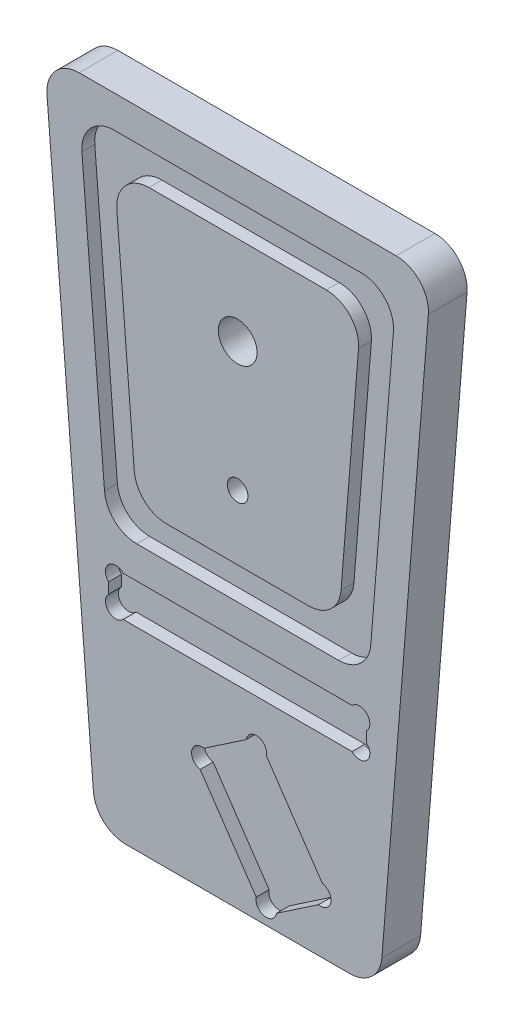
ISO-10303-21;
HEADER;
FILE_DESCRIPTION(('STEP AP214'),'2;1');
FILE_NAME('part.step','',(''),(''),'','','');
FILE_SCHEMA(('AUTOMOTIVE_DESIGN { 1 0 10303 214 1 1 1 1 }'));
ENDSEC;
DATA;
#1=APPLICATION_CONTEXT('core data for automotive mechanical design processes');
#2=APPLICATION_PROTOCOL_DEFINITION('international standard','automotive_design',2000,#1);
#3=PRODUCT_CONTEXT('',#1,'mechanical');
#4=PRODUCT('Part','Part','',(#3));
#5=PRODUCT_RELATED_PRODUCT_CATEGORY('part','',(#4));
#6=PRODUCT_DEFINITION_FORMATION('','',#4);
#7=PRODUCT_DEFINITION_CONTEXT('part definition',#1,'design');
#8=PRODUCT_DEFINITION('design','',#6,#7);
#9=PRODUCT_DEFINITION_SHAPE('','',#8);
#10=(LENGTH_UNIT() NAMED_UNIT(*) SI_UNIT(.MILLI.,.METRE.));
#11=(NAMED_UNIT(*) PLANE_ANGLE_UNIT() SI_UNIT($,.RADIAN.));
#12=(NAMED_UNIT(*) SI_UNIT($,.STERADIAN.) SOLID_ANGLE_UNIT());
#13=UNCERTAINTY_MEASURE_WITH_UNIT(LENGTH_MEASURE(1.E-05),#10,'distance_accuracy_value','');
#14=(GEOMETRIC_REPRESENTATION_CONTEXT(3) GLOBAL_UNCERTAINTY_ASSIGNED_CONTEXT((#13)) GLOBAL_UNIT_ASSIGNED_CONTEXT((#10,
#11,#12)) REPRESENTATION_CONTEXT('',''));
#15=CARTESIAN_POINT('',(0.,0.,0.));
#16=DIRECTION('',(0.,0.,1.));
#17=DIRECTION('',(1.,0.,0.));
#18=AXIS2_PLACEMENT_3D('',#15,#16,#17);
#19=CARTESIAN_POINT('',(-22.,-40.,6.));
#20=DIRECTION('',(0.,1.,0.));
#21=DIRECTION('',(-1.,0.,0.));
#22=AXIS2_PLACEMENT_3D('',#19,#20,#21);
#23=PLANE('',#22);
#24=DIRECTION('',(1.,0.,0.));
#25=VECTOR('',#24,1.);
#26=CARTESIAN_POINT('',(-22.,-40.,0.));
#27=LINE('',#26,#25);
#28=CARTESIAN_POINT('',(-17.3840255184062,-40.,0.));
#29=VERTEX_POINT('',#28);
#30=CARTESIAN_POINT('',(17.3840255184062,-40.,0.));
#31=VERTEX_POINT('',#30);
#32=EDGE_CURVE('E392',#29,#31,#27,.T.);
#33=ORIENTED_EDGE('',*,*,#32,.T.);
#34=DIRECTION('',(0.,0.,-1.));
#35=VECTOR('',#34,1.);
#36=CARTESIAN_POINT('',(17.3840255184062,-40.,6.));
#37=LINE('',#36,#35);
#38=CARTESIAN_POINT('',(17.3840255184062,-40.,6.));
#39=VERTEX_POINT('',#38);
#40=EDGE_CURVE('E33',#31,#39,#37,.F.);
#41=ORIENTED_EDGE('',*,*,#40,.T.);
#42=DIRECTION('',(1.,0.,0.));
#43=VECTOR('',#42,1.);
#44=CARTESIAN_POINT('',(-22.,-40.,6.));
#45=LINE('',#44,#43);
#46=CARTESIAN_POINT('',(-17.3840255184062,-40.,6.));
#47=VERTEX_POINT('',#46);
#48=EDGE_CURVE('E403',#47,#39,#45,.T.);
#49=ORIENTED_EDGE('',*,*,#48,.F.);
#50=DIRECTION('',(0.,0.,-1.));
#51=VECTOR('',#50,1.);
#52=CARTESIAN_POINT('',(-17.3840255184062,-40.,6.));
#53=LINE('',#52,#51);
#54=EDGE_CURVE('E414',#47,#29,#53,.T.);
#55=ORIENTED_EDGE('',*,*,#54,.T.);
#56=EDGE_LOOP('',(#33,#41,#49,#55));
#57=FACE_BOUND('',#56,.T.);
#58=ADVANCED_FACE('F26',(#57),#23,.F.);
#59=CARTESIAN_POINT('',(22.,-40.,6.));
#60=DIRECTION('',(-0.996815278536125,0.0797452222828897,0.));
#61=DIRECTION('',(-0.0797452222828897,-0.996815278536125,0.));
#62=AXIS2_PLACEMENT_3D('',#59,#60,#61);
#63=PLANE('',#62);
#64=DIRECTION('',(0.0797452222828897,0.996815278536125,0.));
#65=VECTOR('',#64,1.);
#66=CARTESIAN_POINT('',(22.,-40.,6.));
#67=LINE('',#66,#65);
#68=CARTESIAN_POINT('',(22.3681019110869,-35.3987261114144,6.));
#69=VERTEX_POINT('',#68);
#70=CARTESIAN_POINT('',(29.5681019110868,54.6012738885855,6.));
#71=VERTEX_POINT('',#70);
#72=EDGE_CURVE('E406',#69,#71,#67,.T.);
#73=ORIENTED_EDGE('',*,*,#72,.F.);
#74=DIRECTION('',(0.,0.,-1.));
#75=VECTOR('',#74,1.);
#76=CARTESIAN_POINT('',(22.3681019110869,-35.3987261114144,6.));
#77=LINE('',#76,#75);
#78=CARTESIAN_POINT('',(22.3681019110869,-35.3987261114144,0.));
#79=VERTEX_POINT('',#78);
#80=EDGE_CURVE('E515',#69,#79,#77,.T.);
#81=ORIENTED_EDGE('',*,*,#80,.T.);
#82=DIRECTION('',(0.0797452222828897,0.996815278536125,0.));
#83=VECTOR('',#82,1.);
#84=CARTESIAN_POINT('',(22.,-40.,0.));
#85=LINE('',#84,#83);
#86=CARTESIAN_POINT('',(29.5681019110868,54.6012738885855,0.));
#87=VERTEX_POINT('',#86);
#88=EDGE_CURVE('E395',#79,#87,#85,.T.);
#89=ORIENTED_EDGE('',*,*,#88,.T.);
#90=DIRECTION('',(0.,0.,-1.));
#91=VECTOR('',#90,1.);
#92=CARTESIAN_POINT('',(29.5681019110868,54.6012738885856,6.));
#93=LINE('',#92,#91);
#94=EDGE_CURVE('E440',#87,#71,#93,.F.);
#95=ORIENTED_EDGE('',*,*,#94,.T.);
#96=EDGE_LOOP('',(#73,#81,#89,#95));
#97=FACE_BOUND('',#96,.T.);
#98=ADVANCED_FACE('F534',(#97),#63,.F.);
#99=CARTESIAN_POINT('',(-30.,60.,6.));
#100=DIRECTION('',(0.,-1.,0.));
#101=DIRECTION('',(1.,0.,0.));
#102=AXIS2_PLACEMENT_3D('',#99,#100,#101);
#103=PLANE('',#102);
#104=DIRECTION('',(-1.,0.,0.));
#105=VECTOR('',#104,1.);
#106=CARTESIAN_POINT('',(-30.,60.,6.));
#107=LINE('',#106,#105);
#108=CARTESIAN_POINT('',(24.5840255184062,60.,6.));
#109=VERTEX_POINT('',#108);
#110=CARTESIAN_POINT('',(-24.5840255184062,60.,6.));
#111=VERTEX_POINT('',#110);
#112=EDGE_CURVE('E408',#109,#111,#107,.T.);
#113=ORIENTED_EDGE('',*,*,#112,.F.);
#114=DIRECTION('',(0.,0.,-1.));
#115=VECTOR('',#114,1.);
#116=CARTESIAN_POINT('',(24.5840255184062,60.,6.));
#117=LINE('',#116,#115);
#118=CARTESIAN_POINT('',(24.5840255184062,60.,0.));
#119=VERTEX_POINT('',#118);
#120=EDGE_CURVE('E437',#109,#119,#117,.T.);
#121=ORIENTED_EDGE('',*,*,#120,.T.);
#122=DIRECTION('',(-1.,0.,0.));
#123=VECTOR('',#122,1.);
#124=CARTESIAN_POINT('',(-30.,60.,0.));
#125=LINE('',#124,#123);
#126=CARTESIAN_POINT('',(-24.5840255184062,60.,0.));
#127=VERTEX_POINT('',#126);
#128=EDGE_CURVE('E397',#119,#127,#125,.T.);
#129=ORIENTED_EDGE('',*,*,#128,.T.);
#130=DIRECTION('',(0.,0.,-1.));
#131=VECTOR('',#130,1.);
#132=CARTESIAN_POINT('',(-24.5840255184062,60.,6.));
#133=LINE('',#132,#131);
#134=EDGE_CURVE('E435',#127,#111,#133,.F.);
#135=ORIENTED_EDGE('',*,*,#134,.T.);
#136=EDGE_LOOP('',(#113,#121,#129,#135));
#137=FACE_BOUND('',#136,.T.);
#138=ADVANCED_FACE('F546',(#137),#103,.F.);
#139=CARTESIAN_POINT('',(-22.,-40.,6.));
#140=DIRECTION('',(0.996815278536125,0.07974522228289,0.));
#141=DIRECTION('',(-0.07974522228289,0.996815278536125,0.));
#142=AXIS2_PLACEMENT_3D('',#139,#140,#141);
#143=PLANE('',#142);
#144=DIRECTION('',(0.07974522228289,-0.996815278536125,0.));
#145=VECTOR('',#144,1.);
#146=CARTESIAN_POINT('',(-22.,-40.,0.));
#147=LINE('',#146,#145);
#148=CARTESIAN_POINT('',(-29.5681019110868,54.6012738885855,0.));
#149=VERTEX_POINT('',#148);
#150=CARTESIAN_POINT('',(-22.3681019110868,-35.3987261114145,0.));
#151=VERTEX_POINT('',#150);
#152=EDGE_CURVE('E400',#149,#151,#147,.T.);
#153=ORIENTED_EDGE('',*,*,#152,.T.);
#154=DIRECTION('',(0.,0.,-1.));
#155=VECTOR('',#154,1.);
#156=CARTESIAN_POINT('',(-22.3681019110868,-35.3987261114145,6.));
#157=LINE('',#156,#155);
#158=CARTESIAN_POINT('',(-22.3681019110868,-35.3987261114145,6.));
#159=VERTEX_POINT('',#158);
#160=EDGE_CURVE('E427',#151,#159,#157,.F.);
#161=ORIENTED_EDGE('',*,*,#160,.T.);
#162=DIRECTION('',(0.07974522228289,-0.996815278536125,0.));
#163=VECTOR('',#162,1.);
#164=CARTESIAN_POINT('',(-22.,-40.,6.));
#165=LINE('',#164,#163);
#166=CARTESIAN_POINT('',(-29.5681019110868,54.6012738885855,6.));
#167=VERTEX_POINT('',#166);
#168=EDGE_CURVE('E411',#167,#159,#165,.T.);
#169=ORIENTED_EDGE('',*,*,#168,.F.);
#170=DIRECTION('',(0.,0.,-1.));
#171=VECTOR('',#170,1.);
#172=CARTESIAN_POINT('',(-29.5681019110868,54.6012738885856,6.));
#173=LINE('',#172,#171);
#174=EDGE_CURVE('E424',#167,#149,#173,.T.);
#175=ORIENTED_EDGE('',*,*,#174,.T.);
#176=EDGE_LOOP('',(#153,#161,#169,#175));
#177=FACE_BOUND('',#176,.T.);
#178=ADVANCED_FACE('F553',(#177),#143,.F.);
#179=CARTESIAN_POINT('',(-22.,-40.,6.));
#180=DIRECTION('',(0.,0.,1.));
#181=DIRECTION('',(1.,0.,0.));
#182=AXIS2_PLACEMENT_3D('',#179,#180,#181);
#183=PLANE('',#182);
#184=CARTESIAN_POINT('',(12.8827860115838,-31.5947640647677,6.));
#185=DIRECTION('',(0.,0.,1.));
#186=DIRECTION('',(1.,0.,0.));
#187=AXIS2_PLACEMENT_3D('',#184,#185,#186);
#188=CIRCLE('',#187,1.6);
#189=CARTESIAN_POINT('',(12.5390059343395,-33.1573949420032,6.));
#190=VERTEX_POINT('',#189);
#191=CARTESIAN_POINT('',(13.1405952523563,-30.015671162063,6.));
#192=VERTEX_POINT('',#191);
#193=EDGE_CURVE('E288',#190,#192,#188,.T.);
#194=ORIENTED_EDGE('',*,*,#193,.F.);
#195=DIRECTION('',(0.827472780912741,0.561505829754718,0.));
#196=VECTOR('',#195,1.);
#197=CARTESIAN_POINT('',(14.410662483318,-31.8873277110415,6.));
#198=LINE('',#197,#196);
#199=CARTESIAN_POINT('',(6.02165654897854,-37.5799327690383,6.));
#200=VERTEX_POINT('',#199);
#201=EDGE_CURVE('E956',#200,#190,#198,.T.);
#202=ORIENTED_EDGE('',*,*,#201,.F.);
#203=CARTESIAN_POINT('',(4.44256364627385,-37.3221235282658,6.));
#204=DIRECTION('',(0.,0.,1.));
#205=DIRECTION('',(1.,0.,0.));
#206=AXIS2_PLACEMENT_3D('',#203,#204,#205);
#207=CIRCLE('',#206,1.6);
#208=CARTESIAN_POINT('',(2.87993276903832,-36.9783434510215,6.));
#209=VERTEX_POINT('',#208);
#210=EDGE_CURVE('E292',#209,#200,#207,.T.);
#211=ORIENTED_EDGE('',*,*,#210,.F.);
#212=DIRECTION('',(0.561505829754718,-0.827472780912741,0.));
#213=VECTOR('',#212,1.);
#214=CARTESIAN_POINT('',(4.15000000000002,-38.85,6.));
#215=LINE('',#214,#213);
#216=CARTESIAN_POINT('',(-5.81004936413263,-24.1722009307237,6.));
#217=VERTEX_POINT('',#216);
#218=EDGE_CURVE('E959',#217,#209,#215,.T.);
#219=ORIENTED_EDGE('',*,*,#218,.F.);
#220=CARTESIAN_POINT('',(-5.55224012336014,-22.593108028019,6.));
#221=DIRECTION('',(0.,0.,1.));
#222=DIRECTION('',(1.,0.,0.));
#223=AXIS2_PLACEMENT_3D('',#220,#221,#222);
#224=CIRCLE('',#223,1.6);
#225=CARTESIAN_POINT('',(-5.20846004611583,-21.0304771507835,6.));
#226=VERTEX_POINT('',#225);
#227=EDGE_CURVE('E973',#226,#217,#224,.T.);
#228=ORIENTED_EDGE('',*,*,#227,.F.);
#229=DIRECTION('',(-0.827472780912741,-0.561505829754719,0.));
#230=VECTOR('',#229,1.);
#231=CARTESIAN_POINT('',(-7.08011659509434,-22.3005443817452,6.));
#232=LINE('',#231,#230);
#233=CARTESIAN_POINT('',(1.30888933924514,-16.6079393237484,6.));
#234=VERTEX_POINT('',#233);
#235=EDGE_CURVE('E961',#234,#226,#232,.T.);
#236=ORIENTED_EDGE('',*,*,#235,.F.);
#237=CARTESIAN_POINT('',(2.88798224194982,-16.8657485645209,6.));
#238=DIRECTION('',(0.,0.,1.));
#239=DIRECTION('',(1.,0.,0.));
#240=AXIS2_PLACEMENT_3D('',#237,#238,#239);
#241=CIRCLE('',#240,1.6);
#242=CARTESIAN_POINT('',(4.45061311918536,-17.2095286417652,6.));
#243=VERTEX_POINT('',#242);
#244=EDGE_CURVE('E983',#243,#234,#241,.T.);
#245=ORIENTED_EDGE('',*,*,#244,.F.);
#246=DIRECTION('',(-0.561505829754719,0.827472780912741,0.));
#247=VECTOR('',#246,1.);
#248=CARTESIAN_POINT('',(3.18054588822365,-15.3378720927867,6.));
#249=LINE('',#248,#247);
#250=EDGE_CURVE('E958',#192,#243,#249,.T.);
#251=ORIENTED_EDGE('',*,*,#250,.F.);
#252=EDGE_LOOP('',(#194,#202,#211,#219,#228,#236,#245,#251));
#253=FACE_BOUND('',#252,.T.);
#254=CARTESIAN_POINT('',(18.9,-8.9,6.));
#255=DIRECTION('',(0.,0.,1.));
#256=DIRECTION('',(1.,0.,0.));
#257=AXIS2_PLACEMENT_3D('',#254,#255,#256);
#258=CIRCLE('',#257,1.6);
#259=CARTESIAN_POINT('',(17.7381049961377,-9.99999999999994,6.));
#260=VERTEX_POINT('',#259);
#261=CARTESIAN_POINT('',(20.,-7.73810499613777,6.));
#262=VERTEX_POINT('',#261);
#263=EDGE_CURVE('E991',#260,#262,#258,.T.);
#264=ORIENTED_EDGE('',*,*,#263,.F.);
#265=DIRECTION('',(1.,0.,0.));
#266=VECTOR('',#265,1.);
#267=CARTESIAN_POINT('',(-20.,-9.99999999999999,6.));
#268=LINE('',#267,#266);
#269=CARTESIAN_POINT('',(-17.7381049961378,-9.99999999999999,6.));
#270=VERTEX_POINT('',#269);
#271=EDGE_CURVE('E377',#270,#260,#268,.T.);
#272=ORIENTED_EDGE('',*,*,#271,.F.);
#273=CARTESIAN_POINT('',(-18.9,-8.9,6.));
#274=DIRECTION('',(0.,0.,1.));
#275=DIRECTION('',(1.,0.,0.));
#276=AXIS2_PLACEMENT_3D('',#273,#274,#275);
#277=CIRCLE('',#276,1.6);
#278=CARTESIAN_POINT('',(-20.,-7.73810499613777,6.));
#279=VERTEX_POINT('',#278);
#280=EDGE_CURVE('E1013',#279,#270,#277,.T.);
#281=ORIENTED_EDGE('',*,*,#280,.F.);
#282=DIRECTION('',(0.,-1.,0.));
#283=VECTOR('',#282,1.);
#284=CARTESIAN_POINT('',(-20.,-3.8,6.));
#285=LINE('',#284,#283);
#286=CARTESIAN_POINT('',(-20.,-6.06189500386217,6.));
#287=VERTEX_POINT('',#286);
#288=EDGE_CURVE('E374',#287,#279,#285,.T.);
#289=ORIENTED_EDGE('',*,*,#288,.F.);
#290=CARTESIAN_POINT('',(-18.9,-4.89999999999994,6.));
#291=DIRECTION('',(0.,0.,1.));
#292=DIRECTION('',(1.,0.,0.));
#293=AXIS2_PLACEMENT_3D('',#290,#291,#292);
#294=CIRCLE('',#293,1.6);
#295=CARTESIAN_POINT('',(-17.7381049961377,-3.79999999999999,6.));
#296=VERTEX_POINT('',#295);
#297=EDGE_CURVE('E1022',#296,#287,#294,.T.);
#298=ORIENTED_EDGE('',*,*,#297,.F.);
#299=DIRECTION('',(-1.,0.,0.));
#300=VECTOR('',#299,1.);
#301=CARTESIAN_POINT('',(20.,-3.79999999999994,6.));
#302=LINE('',#301,#300);
#303=CARTESIAN_POINT('',(17.7381049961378,-3.79999999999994,6.));
#304=VERTEX_POINT('',#303);
#305=EDGE_CURVE('E382',#304,#296,#302,.T.);
#306=ORIENTED_EDGE('',*,*,#305,.F.);
#307=CARTESIAN_POINT('',(18.9,-4.89999999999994,6.));
#308=DIRECTION('',(0.,0.,1.));
#309=DIRECTION('',(1.,0.,0.));
#310=AXIS2_PLACEMENT_3D('',#307,#308,#309);
#311=CIRCLE('',#310,1.6);
#312=CARTESIAN_POINT('',(20.,-6.06189500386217,6.));
#313=VERTEX_POINT('',#312);
#314=EDGE_CURVE('E1002',#313,#304,#311,.T.);
#315=ORIENTED_EDGE('',*,*,#314,.F.);
#316=DIRECTION('',(0.,1.,0.));
#317=VECTOR('',#316,1.);
#318=CARTESIAN_POINT('',(20.,-3.79999999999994,6.));
#319=LINE('',#318,#317);
#320=EDGE_CURVE('E380',#262,#313,#319,.T.);
#321=ORIENTED_EDGE('',*,*,#320,.F.);
#322=EDGE_LOOP('',(#264,#272,#281,#289,#298,#306,#315,#321));
#323=FACE_BOUND('',#322,.T.);
#324=DIRECTION('',(0.07974522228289,-0.996815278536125,0.));
#325=VECTOR('',#324,1.);
#326=CARTESIAN_POINT('',(-24.5840255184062,55.,6.));
#327=LINE('',#326,#325);
#328=CARTESIAN_POINT('',(-24.1521274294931,49.6012738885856,6.));
#329=VERTEX_POINT('',#328);
#330=CARTESIAN_POINT('',(-20.6481274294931,5.80127388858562,6.));
#331=VERTEX_POINT('',#330);
#332=EDGE_CURVE('E350',#329,#331,#327,.T.);
#333=ORIENTED_EDGE('',*,*,#332,.F.);
#334=CARTESIAN_POINT('',(-19.1680510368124,50.,6.));
#335=DIRECTION('',(0.,0.,1.));
#336=DIRECTION('',(1.,0.,0.));
#337=AXIS2_PLACEMENT_3D('',#334,#335,#336);
#338=CIRCLE('',#337,5.);
#339=CARTESIAN_POINT('',(-19.1680510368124,55.,6.));
#340=VERTEX_POINT('',#339);
#341=EDGE_CURVE('E511',#329,#340,#338,.F.);
#342=ORIENTED_EDGE('',*,*,#341,.T.);
#343=DIRECTION('',(-1.,0.,0.));
#344=VECTOR('',#343,1.);
#345=CARTESIAN_POINT('',(24.5840255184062,55.,6.));
#346=LINE('',#345,#344);
#347=CARTESIAN_POINT('',(19.1680510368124,55.,6.));
#348=VERTEX_POINT('',#347);
#349=EDGE_CURVE('E359',#348,#340,#346,.T.);
#350=ORIENTED_EDGE('',*,*,#349,.F.);
#351=CARTESIAN_POINT('',(19.1680510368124,50.,6.));
#352=DIRECTION('',(0.,0.,1.));
#353=DIRECTION('',(1.,0.,0.));
#354=AXIS2_PLACEMENT_3D('',#351,#352,#353);
#355=CIRCLE('',#354,5.);
#356=CARTESIAN_POINT('',(24.1521274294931,49.6012738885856,6.));
#357=VERTEX_POINT('',#356);
#358=EDGE_CURVE('E509',#348,#357,#355,.F.);
#359=ORIENTED_EDGE('',*,*,#358,.T.);
#360=DIRECTION('',(0.07974522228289,0.996815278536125,0.));
#361=VECTOR('',#360,1.);
#362=CARTESIAN_POINT('',(24.5840255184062,55.,6.));
#363=LINE('',#362,#361);
#364=CARTESIAN_POINT('',(20.6481274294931,5.80127388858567,6.));
#365=VERTEX_POINT('',#364);
#366=EDGE_CURVE('E356',#365,#357,#363,.T.);
#367=ORIENTED_EDGE('',*,*,#366,.F.);
#368=CARTESIAN_POINT('',(15.6640510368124,6.20000000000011,6.));
#369=DIRECTION('',(0.,0.,1.));
#370=DIRECTION('',(1.,0.,0.));
#371=AXIS2_PLACEMENT_3D('',#368,#369,#370);
#372=CIRCLE('',#371,5.);
#373=CARTESIAN_POINT('',(15.6640510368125,1.20000000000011,6.));
#374=VERTEX_POINT('',#373);
#375=EDGE_CURVE('E503',#365,#374,#372,.F.);
#376=ORIENTED_EDGE('',*,*,#375,.T.);
#377=DIRECTION('',(1.,0.,0.));
#378=VECTOR('',#377,1.);
#379=CARTESIAN_POINT('',(-20.2800255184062,1.20000000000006,6.));
#380=LINE('',#379,#378);
#381=CARTESIAN_POINT('',(-15.6640510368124,1.20000000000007,6.));
#382=VERTEX_POINT('',#381);
#383=EDGE_CURVE('E353',#382,#374,#380,.T.);
#384=ORIENTED_EDGE('',*,*,#383,.F.);
#385=CARTESIAN_POINT('',(-15.6640510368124,6.20000000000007,6.));
#386=DIRECTION('',(0.,0.,1.));
#387=DIRECTION('',(1.,0.,0.));
#388=AXIS2_PLACEMENT_3D('',#385,#386,#387);
#389=CIRCLE('',#388,5.);
#390=EDGE_CURVE('E501',#382,#331,#389,.F.);
#391=ORIENTED_EDGE('',*,*,#390,.T.);
#392=EDGE_LOOP('',(#333,#342,#350,#359,#367,#376,#384,#391));
#393=FACE_BOUND('',#392,.T.);
#394=ORIENTED_EDGE('',*,*,#48,.T.);
#395=CARTESIAN_POINT('',(17.3840255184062,-35.,6.));
#396=DIRECTION('',(0.,0.,1.));
#397=DIRECTION('',(1.,0.,0.));
#398=AXIS2_PLACEMENT_3D('',#395,#396,#397);
#399=CIRCLE('',#398,5.);
#400=EDGE_CURVE('E11',#39,#69,#399,.T.);
#401=ORIENTED_EDGE('',*,*,#400,.T.);
#402=ORIENTED_EDGE('',*,*,#72,.T.);
#403=CARTESIAN_POINT('',(24.5840255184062,55.,6.));
#404=DIRECTION('',(0.,0.,1.));
#405=DIRECTION('',(1.,0.,0.));
#406=AXIS2_PLACEMENT_3D('',#403,#404,#405);
#407=CIRCLE('',#406,5.);
#408=EDGE_CURVE('E431',#71,#109,#407,.T.);
#409=ORIENTED_EDGE('',*,*,#408,.T.);
#410=ORIENTED_EDGE('',*,*,#112,.T.);
#411=CARTESIAN_POINT('',(-24.5840255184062,55.,6.));
#412=DIRECTION('',(0.,0.,1.));
#413=DIRECTION('',(1.,0.,0.));
#414=AXIS2_PLACEMENT_3D('',#411,#412,#413);
#415=CIRCLE('',#414,5.);
#416=EDGE_CURVE('E429',#111,#167,#415,.T.);
#417=ORIENTED_EDGE('',*,*,#416,.T.);
#418=ORIENTED_EDGE('',*,*,#168,.T.);
#419=CARTESIAN_POINT('',(-17.3840255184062,-35.,6.));
#420=DIRECTION('',(0.,0.,1.));
#421=DIRECTION('',(1.,0.,0.));
#422=AXIS2_PLACEMENT_3D('',#419,#420,#421);
#423=CIRCLE('',#422,5.);
#424=EDGE_CURVE('E433',#159,#47,#423,.T.);
#425=ORIENTED_EDGE('',*,*,#424,.T.);
#426=EDGE_LOOP('',(#394,#401,#402,#409,#410,#417,#418,#425));
#427=FACE_BOUND('',#426,.T.);
#428=ADVANCED_FACE('F527',(#253,#323,#393,#427),#183,.T.);
#429=CARTESIAN_POINT('',(-22.,-40.,0.));
#430=DIRECTION('',(0.,0.,1.));
#431=DIRECTION('',(1.,0.,0.));
#432=AXIS2_PLACEMENT_3D('',#429,#430,#431);
#433=PLANE('',#432);
#434=CARTESIAN_POINT('',(0.,36.2000000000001,0.));
#435=DIRECTION('',(0.,0.,1.));
#436=DIRECTION('',(1.,0.,0.));
#437=AXIS2_PLACEMENT_3D('',#434,#435,#436);
#438=CIRCLE('',#437,3.);
#439=CARTESIAN_POINT('',(3.,36.2000000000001,0.));
#440=VERTEX_POINT('',#439);
#441=EDGE_CURVE('E317',#440,#440,#438,.T.);
#442=ORIENTED_EDGE('',*,*,#441,.T.);
#443=EDGE_LOOP('',(#442));
#444=FACE_BOUND('',#443,.T.);
#445=CARTESIAN_POINT('',(0.,16.2000000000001,0.));
#446=DIRECTION('',(0.,0.,1.));
#447=DIRECTION('',(1.,0.,0.));
#448=AXIS2_PLACEMENT_3D('',#445,#446,#447);
#449=CIRCLE('',#448,1.6);
#450=CARTESIAN_POINT('',(1.6,16.2000000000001,0.));
#451=VERTEX_POINT('',#450);
#452=EDGE_CURVE('E323',#451,#451,#449,.T.);
#453=ORIENTED_EDGE('',*,*,#452,.T.);
#454=EDGE_LOOP('',(#453));
#455=FACE_BOUND('',#454,.T.);
#456=ORIENTED_EDGE('',*,*,#88,.F.);
#457=CARTESIAN_POINT('',(17.3840255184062,-35.,0.));
#458=DIRECTION('',(0.,0.,1.));
#459=DIRECTION('',(1.,0.,0.));
#460=AXIS2_PLACEMENT_3D('',#457,#458,#459);
#461=CIRCLE('',#460,5.);
#462=EDGE_CURVE('E518',#79,#31,#461,.F.);
#463=ORIENTED_EDGE('',*,*,#462,.T.);
#464=ORIENTED_EDGE('',*,*,#32,.F.);
#465=CARTESIAN_POINT('',(-17.3840255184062,-35.,0.));
#466=DIRECTION('',(0.,0.,1.));
#467=DIRECTION('',(1.,0.,0.));
#468=AXIS2_PLACEMENT_3D('',#465,#466,#467);
#469=CIRCLE('',#468,5.);
#470=EDGE_CURVE('E422',#29,#151,#469,.F.);
#471=ORIENTED_EDGE('',*,*,#470,.T.);
#472=ORIENTED_EDGE('',*,*,#152,.F.);
#473=CARTESIAN_POINT('',(-24.5840255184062,55.,0.));
#474=DIRECTION('',(0.,0.,1.));
#475=DIRECTION('',(1.,0.,0.));
#476=AXIS2_PLACEMENT_3D('',#473,#474,#475);
#477=CIRCLE('',#476,5.);
#478=EDGE_CURVE('E417',#149,#127,#477,.F.);
#479=ORIENTED_EDGE('',*,*,#478,.T.);
#480=ORIENTED_EDGE('',*,*,#128,.F.);
#481=CARTESIAN_POINT('',(24.5840255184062,55.,0.));
#482=DIRECTION('',(0.,0.,1.));
#483=DIRECTION('',(1.,0.,0.));
#484=AXIS2_PLACEMENT_3D('',#481,#482,#483);
#485=CIRCLE('',#484,5.);
#486=EDGE_CURVE('E419',#119,#87,#485,.F.);
#487=ORIENTED_EDGE('',*,*,#486,.T.);
#488=EDGE_LOOP('',(#456,#463,#464,#471,#472,#479,#480,#487));
#489=FACE_BOUND('',#488,.T.);
#490=ADVANCED_FACE('F536',(#444,#455,#489),#433,.F.);
#491=CARTESIAN_POINT('',(-17.3840255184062,-35.,6.));
#492=DIRECTION('',(0.,0.,-1.));
#493=DIRECTION('',(-1.,0.,0.));
#494=AXIS2_PLACEMENT_3D('',#491,#492,#493);
#495=CYLINDRICAL_SURFACE('',#494,5.);
#496=ORIENTED_EDGE('',*,*,#424,.F.);
#497=ORIENTED_EDGE('',*,*,#160,.F.);
#498=ORIENTED_EDGE('',*,*,#470,.F.);
#499=ORIENTED_EDGE('',*,*,#54,.F.);
#500=EDGE_LOOP('',(#496,#497,#498,#499));
#501=FACE_BOUND('',#500,.T.);
#502=ADVANCED_FACE('F557',(#501),#495,.T.);
#503=CARTESIAN_POINT('',(24.5840255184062,55.,6.));
#504=DIRECTION('',(0.,0.,-1.));
#505=DIRECTION('',(-1.,0.,0.));
#506=AXIS2_PLACEMENT_3D('',#503,#504,#505);
#507=CYLINDRICAL_SURFACE('',#506,5.);
#508=ORIENTED_EDGE('',*,*,#408,.F.);
#509=ORIENTED_EDGE('',*,*,#94,.F.);
#510=ORIENTED_EDGE('',*,*,#486,.F.);
#511=ORIENTED_EDGE('',*,*,#120,.F.);
#512=EDGE_LOOP('',(#508,#509,#510,#511));
#513=FACE_BOUND('',#512,.T.);
#514=ADVANCED_FACE('F542',(#513),#507,.T.);
#515=CARTESIAN_POINT('',(-24.5840255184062,55.,6.));
#516=DIRECTION('',(0.,0.,-1.));
#517=DIRECTION('',(-1.,0.,0.));
#518=AXIS2_PLACEMENT_3D('',#515,#516,#517);
#519=CYLINDRICAL_SURFACE('',#518,5.);
#520=ORIENTED_EDGE('',*,*,#416,.F.);
#521=ORIENTED_EDGE('',*,*,#134,.F.);
#522=ORIENTED_EDGE('',*,*,#478,.F.);
#523=ORIENTED_EDGE('',*,*,#174,.F.);
#524=EDGE_LOOP('',(#520,#521,#522,#523));
#525=FACE_BOUND('',#524,.T.);
#526=ADVANCED_FACE('F549',(#525),#519,.T.);
#527=CARTESIAN_POINT('',(-20.,-3.8,4.));
#528=DIRECTION('',(-1.,0.,0.));
#529=DIRECTION('',(0.,-1.,0.));
#530=AXIS2_PLACEMENT_3D('',#527,#528,#529);
#531=PLANE('',#530);
#532=ORIENTED_EDGE('',*,*,#288,.T.);
#533=DIRECTION('',(0.,0.,1.));
#534=VECTOR('',#533,1.);
#535=CARTESIAN_POINT('',(-20.,-7.73810499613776,4.));
#536=LINE('',#535,#534);
#537=CARTESIAN_POINT('',(-20.,-7.73810499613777,4.));
#538=VERTEX_POINT('',#537);
#539=EDGE_CURVE('E1019',#279,#538,#536,.F.);
#540=ORIENTED_EDGE('',*,*,#539,.T.);
#541=DIRECTION('',(0.,-1.,0.));
#542=VECTOR('',#541,1.);
#543=CARTESIAN_POINT('',(-20.,-3.8,4.));
#544=LINE('',#543,#542);
#545=CARTESIAN_POINT('',(-20.,-6.06189500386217,4.));
#546=VERTEX_POINT('',#545);
#547=EDGE_CURVE('E384',#546,#538,#544,.T.);
#548=ORIENTED_EDGE('',*,*,#547,.F.);
#549=DIRECTION('',(0.,0.,1.));
#550=VECTOR('',#549,1.);
#551=CARTESIAN_POINT('',(-20.,-6.06189500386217,4.));
#552=LINE('',#551,#550);
#553=EDGE_CURVE('E963',#546,#287,#552,.T.);
#554=ORIENTED_EDGE('',*,*,#553,.T.);
#555=EDGE_LOOP('',(#532,#540,#548,#554));
#556=FACE_BOUND('',#555,.T.);
#557=ADVANCED_FACE('F689',(#556),#531,.F.);
#558=CARTESIAN_POINT('',(20.,-3.79999999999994,4.));
#559=DIRECTION('',(0.,1.,0.));
#560=DIRECTION('',(-1.,0.,0.));
#561=AXIS2_PLACEMENT_3D('',#558,#559,#560);
#562=PLANE('',#561);
#563=DIRECTION('',(-1.,0.,0.));
#564=VECTOR('',#563,1.);
#565=CARTESIAN_POINT('',(20.,-3.79999999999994,4.));
#566=LINE('',#565,#564);
#567=CARTESIAN_POINT('',(17.7381049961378,-3.79999999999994,4.));
#568=VERTEX_POINT('',#567);
#569=CARTESIAN_POINT('',(-17.7381049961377,-3.79999999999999,4.));
#570=VERTEX_POINT('',#569);
#571=EDGE_CURVE('E390',#568,#570,#566,.T.);
#572=ORIENTED_EDGE('',*,*,#571,.F.);
#573=DIRECTION('',(0.,0.,1.));
#574=VECTOR('',#573,1.);
#575=CARTESIAN_POINT('',(17.7381049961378,-3.79999999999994,4.));
#576=LINE('',#575,#574);
#577=EDGE_CURVE('E1010',#568,#304,#576,.T.);
#578=ORIENTED_EDGE('',*,*,#577,.T.);
#579=ORIENTED_EDGE('',*,*,#305,.T.);
#580=DIRECTION('',(0.,0.,1.));
#581=VECTOR('',#580,1.);
#582=CARTESIAN_POINT('',(-17.7381049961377,-3.79999999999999,4.));
#583=LINE('',#582,#581);
#584=EDGE_CURVE('E1027',#296,#570,#583,.F.);
#585=ORIENTED_EDGE('',*,*,#584,.T.);
#586=EDGE_LOOP('',(#572,#578,#579,#585));
#587=FACE_BOUND('',#586,.T.);
#588=ADVANCED_FACE('F685',(#587),#562,.F.);
#589=CARTESIAN_POINT('',(20.,-3.79999999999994,4.));
#590=DIRECTION('',(1.,0.,0.));
#591=DIRECTION('',(0.,1.,0.));
#592=AXIS2_PLACEMENT_3D('',#589,#590,#591);
#593=PLANE('',#592);
#594=DIRECTION('',(0.,1.,0.));
#595=VECTOR('',#594,1.);
#596=CARTESIAN_POINT('',(20.,-3.79999999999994,4.));
#597=LINE('',#596,#595);
#598=CARTESIAN_POINT('',(20.,-7.73810499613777,4.));
#599=VERTEX_POINT('',#598);
#600=CARTESIAN_POINT('',(20.,-6.06189500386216,4.));
#601=VERTEX_POINT('',#600);
#602=EDGE_CURVE('E388',#599,#601,#597,.T.);
#603=ORIENTED_EDGE('',*,*,#602,.F.);
#604=DIRECTION('',(0.,0.,1.));
#605=VECTOR('',#604,1.);
#606=CARTESIAN_POINT('',(20.,-7.73810499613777,4.));
#607=LINE('',#606,#605);
#608=EDGE_CURVE('E999',#599,#262,#607,.T.);
#609=ORIENTED_EDGE('',*,*,#608,.T.);
#610=ORIENTED_EDGE('',*,*,#320,.T.);
#611=DIRECTION('',(0.,0.,1.));
#612=VECTOR('',#611,1.);
#613=CARTESIAN_POINT('',(20.,-6.06189500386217,4.));
#614=LINE('',#613,#612);
#615=EDGE_CURVE('E1007',#313,#601,#614,.F.);
#616=ORIENTED_EDGE('',*,*,#615,.T.);
#617=EDGE_LOOP('',(#603,#609,#610,#616));
#618=FACE_BOUND('',#617,.T.);
#619=ADVANCED_FACE('F688',(#618),#593,.F.);
#620=CARTESIAN_POINT('',(-20.,-9.99999999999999,4.));
#621=DIRECTION('',(0.,-1.,0.));
#622=DIRECTION('',(1.,0.,0.));
#623=AXIS2_PLACEMENT_3D('',#620,#621,#622);
#624=PLANE('',#623);
#625=ORIENTED_EDGE('',*,*,#271,.T.);
#626=DIRECTION('',(0.,0.,1.));
#627=VECTOR('',#626,1.);
#628=CARTESIAN_POINT('',(17.7381049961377,-9.99999999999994,4.));
#629=LINE('',#628,#627);
#630=CARTESIAN_POINT('',(17.7381049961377,-9.99999999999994,4.));
#631=VERTEX_POINT('',#630);
#632=EDGE_CURVE('E996',#260,#631,#629,.F.);
#633=ORIENTED_EDGE('',*,*,#632,.T.);
#634=DIRECTION('',(1.,0.,0.));
#635=VECTOR('',#634,1.);
#636=CARTESIAN_POINT('',(-20.,-9.99999999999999,4.));
#637=LINE('',#636,#635);
#638=CARTESIAN_POINT('',(-17.7381049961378,-9.99999999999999,4.));
#639=VERTEX_POINT('',#638);
#640=EDGE_CURVE('E386',#639,#631,#637,.T.);
#641=ORIENTED_EDGE('',*,*,#640,.F.);
#642=DIRECTION('',(0.,0.,1.));
#643=VECTOR('',#642,1.);
#644=CARTESIAN_POINT('',(-17.7381049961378,-9.99999999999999,4.));
#645=LINE('',#644,#643);
#646=EDGE_CURVE('E1016',#639,#270,#645,.T.);
#647=ORIENTED_EDGE('',*,*,#646,.T.);
#648=EDGE_LOOP('',(#625,#633,#641,#647));
#649=FACE_BOUND('',#648,.T.);
#650=ADVANCED_FACE('F684',(#649),#624,.F.);
#651=CARTESIAN_POINT('',(-20.,-3.8,4.));
#652=DIRECTION('',(0.,0.,-1.));
#653=DIRECTION('',(-1.,0.,0.));
#654=AXIS2_PLACEMENT_3D('',#651,#652,#653);
#655=PLANE('',#654);
#656=CARTESIAN_POINT('',(18.9,-8.9,4.));
#657=DIRECTION('',(0.,0.,1.));
#658=DIRECTION('',(1.,0.,0.));
#659=AXIS2_PLACEMENT_3D('',#656,#657,#658);
#660=CIRCLE('',#659,1.6);
#661=EDGE_CURVE('E993',#631,#599,#660,.T.);
#662=ORIENTED_EDGE('',*,*,#661,.T.);
#663=ORIENTED_EDGE('',*,*,#602,.T.);
#664=CARTESIAN_POINT('',(18.9,-4.89999999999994,4.));
#665=DIRECTION('',(0.,0.,1.));
#666=DIRECTION('',(1.,0.,0.));
#667=AXIS2_PLACEMENT_3D('',#664,#665,#666);
#668=CIRCLE('',#667,1.6);
#669=EDGE_CURVE('E1004',#601,#568,#668,.T.);
#670=ORIENTED_EDGE('',*,*,#669,.T.);
#671=ORIENTED_EDGE('',*,*,#571,.T.);
#672=CARTESIAN_POINT('',(-18.9,-4.89999999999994,4.));
#673=DIRECTION('',(0.,0.,1.));
#674=DIRECTION('',(1.,0.,0.));
#675=AXIS2_PLACEMENT_3D('',#672,#673,#674);
#676=CIRCLE('',#675,1.6);
#677=EDGE_CURVE('E1024',#570,#546,#676,.T.);
#678=ORIENTED_EDGE('',*,*,#677,.T.);
#679=ORIENTED_EDGE('',*,*,#547,.T.);
#680=CARTESIAN_POINT('',(-18.9,-8.9,4.));
#681=DIRECTION('',(0.,0.,1.));
#682=DIRECTION('',(1.,0.,0.));
#683=AXIS2_PLACEMENT_3D('',#680,#681,#682);
#684=CIRCLE('',#683,1.6);
#685=EDGE_CURVE('E48',#538,#639,#684,.T.);
#686=ORIENTED_EDGE('',*,*,#685,.T.);
#687=ORIENTED_EDGE('',*,*,#640,.T.);
#688=EDGE_LOOP('',(#662,#663,#670,#671,#678,#679,#686,#687));
#689=FACE_BOUND('',#688,.T.);
#690=ADVANCED_FACE('F680',(#689),#655,.F.);
#691=CARTESIAN_POINT('',(-24.5840255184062,55.,4.));
#692=DIRECTION('',(-0.996815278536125,-0.07974522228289,0.));
#693=DIRECTION('',(0.07974522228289,-0.996815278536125,0.));
#694=AXIS2_PLACEMENT_3D('',#691,#692,#693);
#695=PLANE('',#694);
#696=ORIENTED_EDGE('',*,*,#332,.T.);
#697=DIRECTION('',(0.,0.,1.));
#698=VECTOR('',#697,1.);
#699=CARTESIAN_POINT('',(-20.6481274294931,5.80127388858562,4.));
#700=LINE('',#699,#698);
#701=CARTESIAN_POINT('',(-20.6481274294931,5.80127388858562,4.));
#702=VERTEX_POINT('',#701);
#703=EDGE_CURVE('E469',#331,#702,#700,.F.);
#704=ORIENTED_EDGE('',*,*,#703,.T.);
#705=DIRECTION('',(0.07974522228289,-0.996815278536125,0.));
#706=VECTOR('',#705,1.);
#707=CARTESIAN_POINT('',(-24.5840255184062,55.,4.));
#708=LINE('',#707,#706);
#709=CARTESIAN_POINT('',(-24.1521274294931,49.6012738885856,4.));
#710=VERTEX_POINT('',#709);
#711=EDGE_CURVE('E362',#710,#702,#708,.T.);
#712=ORIENTED_EDGE('',*,*,#711,.F.);
#713=DIRECTION('',(0.,0.,1.));
#714=VECTOR('',#713,1.);
#715=CARTESIAN_POINT('',(-24.1521274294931,49.6012738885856,6.));
#716=LINE('',#715,#714);
#717=EDGE_CURVE('E466',#710,#329,#716,.T.);
#718=ORIENTED_EDGE('',*,*,#717,.T.);
#719=EDGE_LOOP('',(#696,#704,#712,#718));
#720=FACE_BOUND('',#719,.T.);
#721=ADVANCED_FACE('F670',(#720),#695,.F.);
#722=CARTESIAN_POINT('',(24.5840255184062,55.,4.));
#723=DIRECTION('',(0.,1.,0.));
#724=DIRECTION('',(-1.,0.,0.));
#725=AXIS2_PLACEMENT_3D('',#722,#723,#724);
#726=PLANE('',#725);
#727=DIRECTION('',(-1.,0.,0.));
#728=VECTOR('',#727,1.);
#729=CARTESIAN_POINT('',(24.5840255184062,55.,4.));
#730=LINE('',#729,#728);
#731=CARTESIAN_POINT('',(19.1680510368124,55.,4.));
#732=VERTEX_POINT('',#731);
#733=CARTESIAN_POINT('',(-19.1680510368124,55.,4.));
#734=VERTEX_POINT('',#733);
#735=EDGE_CURVE('E371',#732,#734,#730,.T.);
#736=ORIENTED_EDGE('',*,*,#735,.F.);
#737=DIRECTION('',(0.,0.,1.));
#738=VECTOR('',#737,1.);
#739=CARTESIAN_POINT('',(19.1680510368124,55.,6.));
#740=LINE('',#739,#738);
#741=EDGE_CURVE('E496',#732,#348,#740,.T.);
#742=ORIENTED_EDGE('',*,*,#741,.T.);
#743=ORIENTED_EDGE('',*,*,#349,.T.);
#744=DIRECTION('',(0.,0.,1.));
#745=VECTOR('',#744,1.);
#746=CARTESIAN_POINT('',(-19.1680510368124,55.,4.));
#747=LINE('',#746,#745);
#748=EDGE_CURVE('E494',#340,#734,#747,.F.);
#749=ORIENTED_EDGE('',*,*,#748,.T.);
#750=EDGE_LOOP('',(#736,#742,#743,#749));
#751=FACE_BOUND('',#750,.T.);
#752=ADVANCED_FACE('F666',(#751),#726,.F.);
#753=CARTESIAN_POINT('',(24.5840255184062,55.,4.));
#754=DIRECTION('',(0.996815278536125,-0.07974522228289,0.));
#755=DIRECTION('',(0.07974522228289,0.996815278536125,0.));
#756=AXIS2_PLACEMENT_3D('',#753,#754,#755);
#757=PLANE('',#756);
#758=DIRECTION('',(0.07974522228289,0.996815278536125,0.));
#759=VECTOR('',#758,1.);
#760=CARTESIAN_POINT('',(24.5840255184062,55.,4.));
#761=LINE('',#760,#759);
#762=CARTESIAN_POINT('',(20.6481274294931,5.80127388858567,4.));
#763=VERTEX_POINT('',#762);
#764=CARTESIAN_POINT('',(24.1521274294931,49.6012738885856,4.));
#765=VERTEX_POINT('',#764);
#766=EDGE_CURVE('E368',#763,#765,#761,.T.);
#767=ORIENTED_EDGE('',*,*,#766,.F.);
#768=DIRECTION('',(0.,0.,1.));
#769=VECTOR('',#768,1.);
#770=CARTESIAN_POINT('',(20.6481274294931,5.80127388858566,6.));
#771=LINE('',#770,#769);
#772=EDGE_CURVE('E481',#763,#365,#771,.T.);
#773=ORIENTED_EDGE('',*,*,#772,.T.);
#774=ORIENTED_EDGE('',*,*,#366,.T.);
#775=DIRECTION('',(0.,0.,1.));
#776=VECTOR('',#775,1.);
#777=CARTESIAN_POINT('',(24.1521274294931,49.6012738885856,4.));
#778=LINE('',#777,#776);
#779=EDGE_CURVE('E479',#357,#765,#778,.F.);
#780=ORIENTED_EDGE('',*,*,#779,.T.);
#781=EDGE_LOOP('',(#767,#773,#774,#780));
#782=FACE_BOUND('',#781,.T.);
#783=ADVANCED_FACE('F669',(#782),#757,.F.);
#784=CARTESIAN_POINT('',(-20.2800255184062,1.20000000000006,4.));
#785=DIRECTION('',(0.,-1.,0.));
#786=DIRECTION('',(1.,0.,0.));
#787=AXIS2_PLACEMENT_3D('',#784,#785,#786);
#788=PLANE('',#787);
#789=DIRECTION('',(1.,0.,0.));
#790=VECTOR('',#789,1.);
#791=CARTESIAN_POINT('',(-20.2800255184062,1.20000000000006,4.));
#792=LINE('',#791,#790);
#793=CARTESIAN_POINT('',(-15.6640510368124,1.20000000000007,4.));
#794=VERTEX_POINT('',#793);
#795=CARTESIAN_POINT('',(15.6640510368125,1.20000000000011,4.));
#796=VERTEX_POINT('',#795);
#797=EDGE_CURVE('E365',#794,#796,#792,.T.);
#798=ORIENTED_EDGE('',*,*,#797,.F.);
#799=DIRECTION('',(0.,0.,1.));
#800=VECTOR('',#799,1.);
#801=CARTESIAN_POINT('',(-15.6640510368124,1.20000000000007,6.));
#802=LINE('',#801,#800);
#803=EDGE_CURVE('E463',#794,#382,#802,.T.);
#804=ORIENTED_EDGE('',*,*,#803,.T.);
#805=ORIENTED_EDGE('',*,*,#383,.T.);
#806=DIRECTION('',(0.,0.,1.));
#807=VECTOR('',#806,1.);
#808=CARTESIAN_POINT('',(15.6640510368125,1.20000000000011,4.));
#809=LINE('',#808,#807);
#810=EDGE_CURVE('E461',#374,#796,#809,.F.);
#811=ORIENTED_EDGE('',*,*,#810,.T.);
#812=EDGE_LOOP('',(#798,#804,#805,#811));
#813=FACE_BOUND('',#812,.T.);
#814=ADVANCED_FACE('F665',(#813),#788,.F.);
#815=CARTESIAN_POINT('',(-20.2800255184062,1.20000000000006,4.));
#816=DIRECTION('',(0.,0.,1.));
#817=DIRECTION('',(1.,0.,0.));
#818=AXIS2_PLACEMENT_3D('',#815,#816,#817);
#819=PLANE('',#818);
#820=DIRECTION('',(-1.,0.,0.));
#821=VECTOR('',#820,1.);
#822=CARTESIAN_POINT('',(19.1680510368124,50.,4.));
#823=LINE('',#822,#821);
#824=CARTESIAN_POINT('',(13.7520765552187,50.,4.));
#825=VERTEX_POINT('',#824);
#826=CARTESIAN_POINT('',(-13.7520765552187,50.,4.));
#827=VERTEX_POINT('',#826);
#828=EDGE_CURVE('E347',#825,#827,#823,.T.);
#829=ORIENTED_EDGE('',*,*,#828,.F.);
#830=CARTESIAN_POINT('',(13.7520765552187,45.,4.));
#831=DIRECTION('',(0.,0.,1.));
#832=DIRECTION('',(1.,0.,0.));
#833=AXIS2_PLACEMENT_3D('',#830,#831,#832);
#834=CIRCLE('',#833,5.);
#835=CARTESIAN_POINT('',(18.7361529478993,44.6012738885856,4.));
#836=VERTEX_POINT('',#835);
#837=EDGE_CURVE('E507',#825,#836,#834,.F.);
#838=ORIENTED_EDGE('',*,*,#837,.T.);
#839=DIRECTION('',(0.0797452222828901,0.996815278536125,0.));
#840=VECTOR('',#839,1.);
#841=CARTESIAN_POINT('',(19.1680510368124,50.,4.));
#842=LINE('',#841,#840);
#843=CARTESIAN_POINT('',(16.0321529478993,10.8012738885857,4.));
#844=VERTEX_POINT('',#843);
#845=EDGE_CURVE('E344',#844,#836,#842,.T.);
#846=ORIENTED_EDGE('',*,*,#845,.F.);
#847=CARTESIAN_POINT('',(11.0480765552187,11.2000000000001,4.));
#848=DIRECTION('',(0.,0.,1.));
#849=DIRECTION('',(1.,0.,0.));
#850=AXIS2_PLACEMENT_3D('',#847,#848,#849);
#851=CIRCLE('',#850,5.);
#852=CARTESIAN_POINT('',(11.0480765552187,6.20000000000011,4.));
#853=VERTEX_POINT('',#852);
#854=EDGE_CURVE('E505',#844,#853,#851,.F.);
#855=ORIENTED_EDGE('',*,*,#854,.T.);
#856=DIRECTION('',(1.,0.,0.));
#857=VECTOR('',#856,1.);
#858=CARTESIAN_POINT('',(-15.6640510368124,6.20000000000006,4.));
#859=LINE('',#858,#857);
#860=CARTESIAN_POINT('',(-11.0480765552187,6.20000000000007,4.));
#861=VERTEX_POINT('',#860);
#862=EDGE_CURVE('E341',#861,#853,#859,.T.);
#863=ORIENTED_EDGE('',*,*,#862,.F.);
#864=CARTESIAN_POINT('',(-11.0480765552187,11.2000000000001,4.));
#865=DIRECTION('',(0.,0.,1.));
#866=DIRECTION('',(1.,0.,0.));
#867=AXIS2_PLACEMENT_3D('',#864,#865,#866);
#868=CIRCLE('',#867,5.);
#869=CARTESIAN_POINT('',(-16.0321529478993,10.8012738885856,4.));
#870=VERTEX_POINT('',#869);
#871=EDGE_CURVE('E499',#861,#870,#868,.F.);
#872=ORIENTED_EDGE('',*,*,#871,.T.);
#873=DIRECTION('',(0.07974522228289,-0.996815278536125,0.));
#874=VECTOR('',#873,1.);
#875=CARTESIAN_POINT('',(-19.1680510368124,50.,4.));
#876=LINE('',#875,#874);
#877=CARTESIAN_POINT('',(-18.7361529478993,44.6012738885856,4.));
#878=VERTEX_POINT('',#877);
#879=EDGE_CURVE('E338',#878,#870,#876,.T.);
#880=ORIENTED_EDGE('',*,*,#879,.F.);
#881=CARTESIAN_POINT('',(-13.7520765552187,45.,4.));
#882=DIRECTION('',(0.,0.,1.));
#883=DIRECTION('',(1.,0.,0.));
#884=AXIS2_PLACEMENT_3D('',#881,#882,#883);
#885=CIRCLE('',#884,5.);
#886=EDGE_CURVE('E513',#878,#827,#885,.F.);
#887=ORIENTED_EDGE('',*,*,#886,.T.);
#888=EDGE_LOOP('',(#829,#838,#846,#855,#863,#872,#880,#887));
#889=FACE_BOUND('',#888,.T.);
#890=ORIENTED_EDGE('',*,*,#711,.T.);
#891=CARTESIAN_POINT('',(-15.6640510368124,6.20000000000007,4.));
#892=DIRECTION('',(0.,0.,1.));
#893=DIRECTION('',(1.,0.,0.));
#894=AXIS2_PLACEMENT_3D('',#891,#892,#893);
#895=CIRCLE('',#894,5.);
#896=EDGE_CURVE('E477',#702,#794,#895,.T.);
#897=ORIENTED_EDGE('',*,*,#896,.T.);
#898=ORIENTED_EDGE('',*,*,#797,.T.);
#899=CARTESIAN_POINT('',(15.6640510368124,6.20000000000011,4.));
#900=DIRECTION('',(0.,0.,1.));
#901=DIRECTION('',(1.,0.,0.));
#902=AXIS2_PLACEMENT_3D('',#899,#900,#901);
#903=CIRCLE('',#902,5.);
#904=EDGE_CURVE('E475',#796,#763,#903,.T.);
#905=ORIENTED_EDGE('',*,*,#904,.T.);
#906=ORIENTED_EDGE('',*,*,#766,.T.);
#907=CARTESIAN_POINT('',(19.1680510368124,50.,4.));
#908=DIRECTION('',(0.,0.,1.));
#909=DIRECTION('',(1.,0.,0.));
#910=AXIS2_PLACEMENT_3D('',#907,#908,#909);
#911=CIRCLE('',#910,5.);
#912=EDGE_CURVE('E473',#765,#732,#911,.T.);
#913=ORIENTED_EDGE('',*,*,#912,.T.);
#914=ORIENTED_EDGE('',*,*,#735,.T.);
#915=CARTESIAN_POINT('',(-19.1680510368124,50.,4.));
#916=DIRECTION('',(0.,0.,1.));
#917=DIRECTION('',(1.,0.,0.));
#918=AXIS2_PLACEMENT_3D('',#915,#916,#917);
#919=CIRCLE('',#918,5.);
#920=EDGE_CURVE('E471',#734,#710,#919,.T.);
#921=ORIENTED_EDGE('',*,*,#920,.T.);
#922=EDGE_LOOP('',(#890,#897,#898,#905,#906,#913,#914,#921));
#923=FACE_BOUND('',#922,.T.);
#924=ADVANCED_FACE('F620',(#889,#923),#819,.T.);
#925=CARTESIAN_POINT('',(-19.1680510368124,50.,4.));
#926=DIRECTION('',(-0.996815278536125,-0.07974522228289,0.));
#927=DIRECTION('',(0.07974522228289,-0.996815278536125,0.));
#928=AXIS2_PLACEMENT_3D('',#925,#926,#927);
#929=PLANE('',#928);
#930=ORIENTED_EDGE('',*,*,#879,.T.);
#931=DIRECTION('',(0.,0.,1.));
#932=VECTOR('',#931,1.);
#933=CARTESIAN_POINT('',(-16.0321529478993,10.8012738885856,4.));
#934=LINE('',#933,#932);
#935=CARTESIAN_POINT('',(-16.0321529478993,10.8012738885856,6.));
#936=VERTEX_POINT('',#935);
#937=EDGE_CURVE('E445',#870,#936,#934,.T.);
#938=ORIENTED_EDGE('',*,*,#937,.T.);
#939=DIRECTION('',(0.07974522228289,-0.996815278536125,0.));
#940=VECTOR('',#939,1.);
#941=CARTESIAN_POINT('',(-19.1680510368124,50.,6.));
#942=LINE('',#941,#940);
#943=CARTESIAN_POINT('',(-18.7361529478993,44.6012738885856,6.));
#944=VERTEX_POINT('',#943);
#945=EDGE_CURVE('E326',#944,#936,#942,.T.);
#946=ORIENTED_EDGE('',*,*,#945,.F.);
#947=DIRECTION('',(0.,0.,1.));
#948=VECTOR('',#947,1.);
#949=CARTESIAN_POINT('',(-18.7361529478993,44.6012738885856,4.));
#950=LINE('',#949,#948);
#951=EDGE_CURVE('E443',#944,#878,#950,.F.);
#952=ORIENTED_EDGE('',*,*,#951,.T.);
#953=EDGE_LOOP('',(#930,#938,#946,#952));
#954=FACE_BOUND('',#953,.T.);
#955=ADVANCED_FACE('F611',(#954),#929,.T.);
#956=CARTESIAN_POINT('',(19.1680510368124,50.,4.));
#957=DIRECTION('',(0.,1.,0.));
#958=DIRECTION('',(-1.,0.,0.));
#959=AXIS2_PLACEMENT_3D('',#956,#957,#958);
#960=PLANE('',#959);
#961=DIRECTION('',(-1.,0.,0.));
#962=VECTOR('',#961,1.);
#963=CARTESIAN_POINT('',(19.1680510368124,50.,6.));
#964=LINE('',#963,#962);
#965=CARTESIAN_POINT('',(13.7520765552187,50.,6.));
#966=VERTEX_POINT('',#965);
#967=CARTESIAN_POINT('',(-13.7520765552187,50.,6.));
#968=VERTEX_POINT('',#967);
#969=EDGE_CURVE('E335',#966,#968,#964,.T.);
#970=ORIENTED_EDGE('',*,*,#969,.F.);
#971=DIRECTION('',(0.,0.,1.));
#972=VECTOR('',#971,1.);
#973=CARTESIAN_POINT('',(13.7520765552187,50.,4.));
#974=LINE('',#973,#972);
#975=EDGE_CURVE('E492',#966,#825,#974,.F.);
#976=ORIENTED_EDGE('',*,*,#975,.T.);
#977=ORIENTED_EDGE('',*,*,#828,.T.);
#978=DIRECTION('',(0.,0.,1.));
#979=VECTOR('',#978,1.);
#980=CARTESIAN_POINT('',(-13.7520765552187,50.,4.));
#981=LINE('',#980,#979);
#982=EDGE_CURVE('E489',#827,#968,#981,.T.);
#983=ORIENTED_EDGE('',*,*,#982,.T.);
#984=EDGE_LOOP('',(#970,#976,#977,#983));
#985=FACE_BOUND('',#984,.T.);
#986=ADVANCED_FACE('F625',(#985),#960,.T.);
#987=CARTESIAN_POINT('',(19.1680510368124,50.,4.));
#988=DIRECTION('',(0.996815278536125,-0.0797452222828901,0.));
#989=DIRECTION('',(0.0797452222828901,0.996815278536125,0.));
#990=AXIS2_PLACEMENT_3D('',#987,#988,#989);
#991=PLANE('',#990);
#992=DIRECTION('',(0.0797452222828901,0.996815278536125,0.));
#993=VECTOR('',#992,1.);
#994=CARTESIAN_POINT('',(19.1680510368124,50.,6.));
#995=LINE('',#994,#993);
#996=CARTESIAN_POINT('',(16.0321529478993,10.8012738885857,6.));
#997=VERTEX_POINT('',#996);
#998=CARTESIAN_POINT('',(18.7361529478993,44.6012738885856,6.));
#999=VERTEX_POINT('',#998);
#1000=EDGE_CURVE('E332',#997,#999,#995,.T.);
#1001=ORIENTED_EDGE('',*,*,#1000,.F.);
#1002=DIRECTION('',(0.,0.,1.));
#1003=VECTOR('',#1002,1.);
#1004=CARTESIAN_POINT('',(16.0321529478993,10.8012738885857,4.));
#1005=LINE('',#1004,#1003);
#1006=EDGE_CURVE('E487',#997,#844,#1005,.F.);
#1007=ORIENTED_EDGE('',*,*,#1006,.T.);
#1008=ORIENTED_EDGE('',*,*,#845,.T.);
#1009=DIRECTION('',(0.,0.,1.));
#1010=VECTOR('',#1009,1.);
#1011=CARTESIAN_POINT('',(18.7361529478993,44.6012738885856,4.));
#1012=LINE('',#1011,#1010);
#1013=EDGE_CURVE('E484',#836,#999,#1012,.T.);
#1014=ORIENTED_EDGE('',*,*,#1013,.T.);
#1015=EDGE_LOOP('',(#1001,#1007,#1008,#1014));
#1016=FACE_BOUND('',#1015,.T.);
#1017=ADVANCED_FACE('F600',(#1016),#991,.T.);
#1018=CARTESIAN_POINT('',(-15.6640510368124,6.20000000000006,4.));
#1019=DIRECTION('',(0.,-1.,0.));
#1020=DIRECTION('',(1.,0.,0.));
#1021=AXIS2_PLACEMENT_3D('',#1018,#1019,#1020);
#1022=PLANE('',#1021);
#1023=DIRECTION('',(1.,0.,0.));
#1024=VECTOR('',#1023,1.);
#1025=CARTESIAN_POINT('',(-15.6640510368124,6.20000000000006,6.));
#1026=LINE('',#1025,#1024);
#1027=CARTESIAN_POINT('',(-11.0480765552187,6.20000000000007,6.));
#1028=VERTEX_POINT('',#1027);
#1029=CARTESIAN_POINT('',(11.0480765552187,6.20000000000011,6.));
#1030=VERTEX_POINT('',#1029);
#1031=EDGE_CURVE('E329',#1028,#1030,#1026,.T.);
#1032=ORIENTED_EDGE('',*,*,#1031,.F.);
#1033=DIRECTION('',(0.,0.,1.));
#1034=VECTOR('',#1033,1.);
#1035=CARTESIAN_POINT('',(-11.0480765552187,6.20000000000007,4.));
#1036=LINE('',#1035,#1034);
#1037=EDGE_CURVE('E459',#1028,#861,#1036,.F.);
#1038=ORIENTED_EDGE('',*,*,#1037,.T.);
#1039=ORIENTED_EDGE('',*,*,#862,.T.);
#1040=DIRECTION('',(0.,0.,1.));
#1041=VECTOR('',#1040,1.);
#1042=CARTESIAN_POINT('',(11.0480765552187,6.20000000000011,4.));
#1043=LINE('',#1042,#1041);
#1044=EDGE_CURVE('E456',#853,#1030,#1043,.T.);
#1045=ORIENTED_EDGE('',*,*,#1044,.T.);
#1046=EDGE_LOOP('',(#1032,#1038,#1039,#1045));
#1047=FACE_BOUND('',#1046,.T.);
#1048=ADVANCED_FACE('F589',(#1047),#1022,.T.);
#1049=CARTESIAN_POINT('',(0.,36.2000000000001,6.));
#1050=DIRECTION('',(0.,0.,1.));
#1051=DIRECTION('',(1.,0.,0.));
#1052=AXIS2_PLACEMENT_3D('',#1049,#1050,#1051);
#1053=CIRCLE('',#1052,3.);
#1054=CARTESIAN_POINT('',(3.,36.2000000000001,6.));
#1055=VERTEX_POINT('',#1054);
#1056=EDGE_CURVE('E309',#1055,#1055,#1053,.T.);
#1057=ORIENTED_EDGE('',*,*,#1056,.F.);
#1058=EDGE_LOOP('',(#1057));
#1059=FACE_BOUND('',#1058,.T.);
#1060=CARTESIAN_POINT('',(0.,16.2000000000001,6.));
#1061=DIRECTION('',(0.,0.,1.));
#1062=DIRECTION('',(1.,0.,0.));
#1063=AXIS2_PLACEMENT_3D('',#1060,#1061,#1062);
#1064=CIRCLE('',#1063,1.6);
#1065=CARTESIAN_POINT('',(1.6,16.2000000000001,6.));
#1066=VERTEX_POINT('',#1065);
#1067=EDGE_CURVE('E320',#1066,#1066,#1064,.T.);
#1068=ORIENTED_EDGE('',*,*,#1067,.F.);
#1069=EDGE_LOOP('',(#1068));
#1070=FACE_BOUND('',#1069,.T.);
#1071=ORIENTED_EDGE('',*,*,#945,.T.);
#1072=CARTESIAN_POINT('',(-11.0480765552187,11.2000000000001,6.));
#1073=DIRECTION('',(0.,0.,1.));
#1074=DIRECTION('',(1.,0.,0.));
#1075=AXIS2_PLACEMENT_3D('',#1072,#1073,#1074);
#1076=CIRCLE('',#1075,5.);
#1077=EDGE_CURVE('E454',#936,#1028,#1076,.T.);
#1078=ORIENTED_EDGE('',*,*,#1077,.T.);
#1079=ORIENTED_EDGE('',*,*,#1031,.T.);
#1080=CARTESIAN_POINT('',(11.0480765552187,11.2000000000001,6.));
#1081=DIRECTION('',(0.,0.,1.));
#1082=DIRECTION('',(1.,0.,0.));
#1083=AXIS2_PLACEMENT_3D('',#1080,#1081,#1082);
#1084=CIRCLE('',#1083,5.);
#1085=EDGE_CURVE('E452',#1030,#997,#1084,.T.);
#1086=ORIENTED_EDGE('',*,*,#1085,.T.);
#1087=ORIENTED_EDGE('',*,*,#1000,.T.);
#1088=CARTESIAN_POINT('',(13.7520765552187,45.,6.));
#1089=DIRECTION('',(0.,0.,1.));
#1090=DIRECTION('',(1.,0.,0.));
#1091=AXIS2_PLACEMENT_3D('',#1088,#1089,#1090);
#1092=CIRCLE('',#1091,5.);
#1093=EDGE_CURVE('E450',#999,#966,#1092,.T.);
#1094=ORIENTED_EDGE('',*,*,#1093,.T.);
#1095=ORIENTED_EDGE('',*,*,#969,.T.);
#1096=CARTESIAN_POINT('',(-13.7520765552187,45.,6.));
#1097=DIRECTION('',(0.,0.,1.));
#1098=DIRECTION('',(1.,0.,0.));
#1099=AXIS2_PLACEMENT_3D('',#1096,#1097,#1098);
#1100=CIRCLE('',#1099,5.);
#1101=EDGE_CURVE('E448',#968,#944,#1100,.T.);
#1102=ORIENTED_EDGE('',*,*,#1101,.T.);
#1103=EDGE_LOOP('',(#1071,#1078,#1079,#1086,#1087,#1094,#1095,#1102));
#1104=FACE_BOUND('',#1103,.T.);
#1105=ADVANCED_FACE('F581',(#1059,#1070,#1104),#183,.T.);
#1106=CARTESIAN_POINT('',(-11.0480765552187,11.2000000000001,4.));
#1107=DIRECTION('',(0.,0.,1.));
#1108=DIRECTION('',(1.,0.,0.));
#1109=AXIS2_PLACEMENT_3D('',#1106,#1107,#1108);
#1110=CYLINDRICAL_SURFACE('',#1109,5.);
#1111=ORIENTED_EDGE('',*,*,#871,.F.);
#1112=ORIENTED_EDGE('',*,*,#1037,.F.);
#1113=ORIENTED_EDGE('',*,*,#1077,.F.);
#1114=ORIENTED_EDGE('',*,*,#937,.F.);
#1115=EDGE_LOOP('',(#1111,#1112,#1113,#1114));
#1116=FACE_BOUND('',#1115,.T.);
#1117=ADVANCED_FACE('F588',(#1116),#1110,.T.);
#1118=CARTESIAN_POINT('',(-15.6640510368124,6.20000000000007,4.));
#1119=DIRECTION('',(0.,0.,-1.));
#1120=DIRECTION('',(-1.,0.,0.));
#1121=AXIS2_PLACEMENT_3D('',#1118,#1119,#1120);
#1122=CYLINDRICAL_SURFACE('',#1121,5.);
#1123=ORIENTED_EDGE('',*,*,#896,.F.);
#1124=ORIENTED_EDGE('',*,*,#703,.F.);
#1125=ORIENTED_EDGE('',*,*,#390,.F.);
#1126=ORIENTED_EDGE('',*,*,#803,.F.);
#1127=EDGE_LOOP('',(#1123,#1124,#1125,#1126));
#1128=FACE_BOUND('',#1127,.T.);
#1129=ADVANCED_FACE('F596',(#1128),#1122,.F.);
#1130=CARTESIAN_POINT('',(15.6640510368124,6.20000000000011,4.));
#1131=DIRECTION('',(0.,0.,-1.));
#1132=DIRECTION('',(-1.,0.,0.));
#1133=AXIS2_PLACEMENT_3D('',#1130,#1131,#1132);
#1134=CYLINDRICAL_SURFACE('',#1133,5.);
#1135=ORIENTED_EDGE('',*,*,#904,.F.);
#1136=ORIENTED_EDGE('',*,*,#810,.F.);
#1137=ORIENTED_EDGE('',*,*,#375,.F.);
#1138=ORIENTED_EDGE('',*,*,#772,.F.);
#1139=EDGE_LOOP('',(#1135,#1136,#1137,#1138));
#1140=FACE_BOUND('',#1139,.T.);
#1141=ADVANCED_FACE('F642',(#1140),#1134,.F.);
#1142=CARTESIAN_POINT('',(11.0480765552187,11.2000000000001,4.));
#1143=DIRECTION('',(0.,0.,1.));
#1144=DIRECTION('',(1.,0.,0.));
#1145=AXIS2_PLACEMENT_3D('',#1142,#1143,#1144);
#1146=CYLINDRICAL_SURFACE('',#1145,5.);
#1147=ORIENTED_EDGE('',*,*,#854,.F.);
#1148=ORIENTED_EDGE('',*,*,#1006,.F.);
#1149=ORIENTED_EDGE('',*,*,#1085,.F.);
#1150=ORIENTED_EDGE('',*,*,#1044,.F.);
#1151=EDGE_LOOP('',(#1147,#1148,#1149,#1150));
#1152=FACE_BOUND('',#1151,.T.);
#1153=ADVANCED_FACE('F636',(#1152),#1146,.T.);
#1154=CARTESIAN_POINT('',(13.7520765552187,45.,4.));
#1155=DIRECTION('',(0.,0.,1.));
#1156=DIRECTION('',(1.,0.,0.));
#1157=AXIS2_PLACEMENT_3D('',#1154,#1155,#1156);
#1158=CYLINDRICAL_SURFACE('',#1157,5.);
#1159=ORIENTED_EDGE('',*,*,#837,.F.);
#1160=ORIENTED_EDGE('',*,*,#975,.F.);
#1161=ORIENTED_EDGE('',*,*,#1093,.F.);
#1162=ORIENTED_EDGE('',*,*,#1013,.F.);
#1163=EDGE_LOOP('',(#1159,#1160,#1161,#1162));
#1164=FACE_BOUND('',#1163,.T.);
#1165=ADVANCED_FACE('F628',(#1164),#1158,.T.);
#1166=CARTESIAN_POINT('',(19.1680510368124,50.,4.));
#1167=DIRECTION('',(0.,0.,-1.));
#1168=DIRECTION('',(-1.,0.,0.));
#1169=AXIS2_PLACEMENT_3D('',#1166,#1167,#1168);
#1170=CYLINDRICAL_SURFACE('',#1169,5.);
#1171=ORIENTED_EDGE('',*,*,#912,.F.);
#1172=ORIENTED_EDGE('',*,*,#779,.F.);
#1173=ORIENTED_EDGE('',*,*,#358,.F.);
#1174=ORIENTED_EDGE('',*,*,#741,.F.);
#1175=EDGE_LOOP('',(#1171,#1172,#1173,#1174));
#1176=FACE_BOUND('',#1175,.T.);
#1177=ADVANCED_FACE('F648',(#1176),#1170,.F.);
#1178=CARTESIAN_POINT('',(-19.1680510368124,50.,4.));
#1179=DIRECTION('',(0.,0.,-1.));
#1180=DIRECTION('',(-1.,0.,0.));
#1181=AXIS2_PLACEMENT_3D('',#1178,#1179,#1180);
#1182=CYLINDRICAL_SURFACE('',#1181,5.);
#1183=ORIENTED_EDGE('',*,*,#920,.F.);
#1184=ORIENTED_EDGE('',*,*,#748,.F.);
#1185=ORIENTED_EDGE('',*,*,#341,.F.);
#1186=ORIENTED_EDGE('',*,*,#717,.F.);
#1187=EDGE_LOOP('',(#1183,#1184,#1185,#1186));
#1188=FACE_BOUND('',#1187,.T.);
#1189=ADVANCED_FACE('F766',(#1188),#1182,.F.);
#1190=CARTESIAN_POINT('',(-13.7520765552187,45.,4.));
#1191=DIRECTION('',(0.,0.,1.));
#1192=DIRECTION('',(1.,0.,0.));
#1193=AXIS2_PLACEMENT_3D('',#1190,#1191,#1192);
#1194=CYLINDRICAL_SURFACE('',#1193,5.);
#1195=ORIENTED_EDGE('',*,*,#886,.F.);
#1196=ORIENTED_EDGE('',*,*,#951,.F.);
#1197=ORIENTED_EDGE('',*,*,#1101,.F.);
#1198=ORIENTED_EDGE('',*,*,#982,.F.);
#1199=EDGE_LOOP('',(#1195,#1196,#1197,#1198));
#1200=FACE_BOUND('',#1199,.T.);
#1201=ADVANCED_FACE('F616',(#1200),#1194,.T.);
#1202=CARTESIAN_POINT('',(0.,16.2000000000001,0.));
#1203=DIRECTION('',(0.,0.,1.));
#1204=DIRECTION('',(1.,0.,0.));
#1205=AXIS2_PLACEMENT_3D('',#1202,#1203,#1204);
#1206=CYLINDRICAL_SURFACE('',#1205,1.6);
#1207=ORIENTED_EDGE('',*,*,#452,.F.);
#1208=EDGE_LOOP('',(#1207));
#1209=FACE_BOUND('',#1208,.T.);
#1210=ORIENTED_EDGE('',*,*,#1067,.T.);
#1211=EDGE_LOOP('',(#1210));
#1212=FACE_BOUND('',#1211,.T.);
#1213=ADVANCED_FACE('F779',(#1209,#1212),#1206,.F.);
#1214=CARTESIAN_POINT('',(0.,36.2000000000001,0.));
#1215=DIRECTION('',(0.,0.,1.));
#1216=DIRECTION('',(1.,0.,0.));
#1217=AXIS2_PLACEMENT_3D('',#1214,#1215,#1216);
#1218=CYLINDRICAL_SURFACE('',#1217,3.);
#1219=ORIENTED_EDGE('',*,*,#441,.F.);
#1220=EDGE_LOOP('',(#1219));
#1221=FACE_BOUND('',#1220,.T.);
#1222=ORIENTED_EDGE('',*,*,#1056,.T.);
#1223=EDGE_LOOP('',(#1222));
#1224=FACE_BOUND('',#1223,.T.);
#1225=ADVANCED_FACE('F785',(#1221,#1224),#1218,.F.);
#1226=CARTESIAN_POINT('',(4.15000000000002,-38.85,4.));
#1227=DIRECTION('',(-0.827472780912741,-0.561505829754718,0.));
#1228=DIRECTION('',(0.561505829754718,-0.827472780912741,0.));
#1229=AXIS2_PLACEMENT_3D('',#1226,#1227,#1228);
#1230=PLANE('',#1229);
#1231=ORIENTED_EDGE('',*,*,#218,.T.);
#1232=DIRECTION('',(0.,0.,1.));
#1233=VECTOR('',#1232,1.);
#1234=CARTESIAN_POINT('',(2.87993276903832,-36.9783434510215,4.));
#1235=LINE('',#1234,#1233);
#1236=CARTESIAN_POINT('',(2.87993276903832,-36.9783434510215,4.));
#1237=VERTEX_POINT('',#1236);
#1238=EDGE_CURVE('E950',#209,#1237,#1235,.F.);
#1239=ORIENTED_EDGE('',*,*,#1238,.T.);
#1240=DIRECTION('',(0.561505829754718,-0.827472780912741,0.));
#1241=VECTOR('',#1240,1.);
#1242=CARTESIAN_POINT('',(4.15000000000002,-38.85,4.));
#1243=LINE('',#1242,#1241);
#1244=CARTESIAN_POINT('',(-5.81004936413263,-24.1722009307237,4.));
#1245=VERTEX_POINT('',#1244);
#1246=EDGE_CURVE('E311',#1245,#1237,#1243,.T.);
#1247=ORIENTED_EDGE('',*,*,#1246,.F.);
#1248=DIRECTION('',(0.,0.,1.));
#1249=VECTOR('',#1248,1.);
#1250=CARTESIAN_POINT('',(-5.81004936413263,-24.1722009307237,4.));
#1251=LINE('',#1250,#1249);
#1252=EDGE_CURVE('E972',#1245,#217,#1251,.T.);
#1253=ORIENTED_EDGE('',*,*,#1252,.T.);
#1254=EDGE_LOOP('',(#1231,#1239,#1247,#1253));
#1255=FACE_BOUND('',#1254,.T.);
#1256=ADVANCED_FACE('F792',(#1255),#1230,.F.);
#1257=CARTESIAN_POINT('',(-7.08011659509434,-22.3005443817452,4.));
#1258=DIRECTION('',(-0.561505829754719,0.827472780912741,0.));
#1259=DIRECTION('',(-0.827472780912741,-0.561505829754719,0.));
#1260=AXIS2_PLACEMENT_3D('',#1257,#1258,#1259);
#1261=PLANE('',#1260);
#1262=ORIENTED_EDGE('',*,*,#235,.T.);
#1263=DIRECTION('',(0.,0.,1.));
#1264=VECTOR('',#1263,1.);
#1265=CARTESIAN_POINT('',(-5.20846004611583,-21.0304771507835,4.));
#1266=LINE('',#1265,#1264);
#1267=CARTESIAN_POINT('',(-5.20846004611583,-21.0304771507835,4.));
#1268=VERTEX_POINT('',#1267);
#1269=EDGE_CURVE('E979',#226,#1268,#1266,.F.);
#1270=ORIENTED_EDGE('',*,*,#1269,.T.);
#1271=DIRECTION('',(-0.827472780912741,-0.561505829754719,0.));
#1272=VECTOR('',#1271,1.);
#1273=CARTESIAN_POINT('',(-7.08011659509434,-22.3005443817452,4.));
#1274=LINE('',#1273,#1272);
#1275=CARTESIAN_POINT('',(1.30888933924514,-16.6079393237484,4.));
#1276=VERTEX_POINT('',#1275);
#1277=EDGE_CURVE('E306',#1276,#1268,#1274,.T.);
#1278=ORIENTED_EDGE('',*,*,#1277,.F.);
#1279=DIRECTION('',(0.,0.,1.));
#1280=VECTOR('',#1279,1.);
#1281=CARTESIAN_POINT('',(1.30888933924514,-16.6079393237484,4.));
#1282=LINE('',#1281,#1280);
#1283=EDGE_CURVE('E988',#1276,#234,#1282,.T.);
#1284=ORIENTED_EDGE('',*,*,#1283,.T.);
#1285=EDGE_LOOP('',(#1262,#1270,#1278,#1284));
#1286=FACE_BOUND('',#1285,.T.);
#1287=ADVANCED_FACE('F800',(#1286),#1261,.F.);
#1288=CARTESIAN_POINT('',(3.18054588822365,-15.3378720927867,4.));
#1289=DIRECTION('',(0.827472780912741,0.561505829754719,0.));
#1290=DIRECTION('',(-0.561505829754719,0.827472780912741,0.));
#1291=AXIS2_PLACEMENT_3D('',#1288,#1289,#1290);
#1292=PLANE('',#1291);
#1293=DIRECTION('',(-0.561505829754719,0.827472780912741,0.));
#1294=VECTOR('',#1293,1.);
#1295=CARTESIAN_POINT('',(3.18054588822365,-15.3378720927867,4.));
#1296=LINE('',#1295,#1294);
#1297=CARTESIAN_POINT('',(13.1405952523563,-30.015671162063,4.));
#1298=VERTEX_POINT('',#1297);
#1299=CARTESIAN_POINT('',(4.45061311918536,-17.2095286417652,4.));
#1300=VERTEX_POINT('',#1299);
#1301=EDGE_CURVE('E297',#1298,#1300,#1296,.T.);
#1302=ORIENTED_EDGE('',*,*,#1301,.F.);
#1303=DIRECTION('',(0.,0.,1.));
#1304=VECTOR('',#1303,1.);
#1305=CARTESIAN_POINT('',(13.1405952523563,-30.015671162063,4.));
#1306=LINE('',#1305,#1304);
#1307=EDGE_CURVE('E282',#1298,#192,#1306,.T.);
#1308=ORIENTED_EDGE('',*,*,#1307,.T.);
#1309=ORIENTED_EDGE('',*,*,#250,.T.);
#1310=DIRECTION('',(0.,0.,1.));
#1311=VECTOR('',#1310,1.);
#1312=CARTESIAN_POINT('',(4.45061311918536,-17.2095286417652,4.));
#1313=LINE('',#1312,#1311);
#1314=EDGE_CURVE('E305',#243,#1300,#1313,.F.);
#1315=ORIENTED_EDGE('',*,*,#1314,.T.);
#1316=EDGE_LOOP('',(#1302,#1308,#1309,#1315));
#1317=FACE_BOUND('',#1316,.T.);
#1318=ADVANCED_FACE('F303',(#1317),#1292,.F.);
#1319=CARTESIAN_POINT('',(14.410662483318,-31.8873277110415,4.));
#1320=DIRECTION('',(0.561505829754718,-0.827472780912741,0.));
#1321=DIRECTION('',(0.827472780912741,0.561505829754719,0.));
#1322=AXIS2_PLACEMENT_3D('',#1319,#1320,#1321);
#1323=PLANE('',#1322);
#1324=ORIENTED_EDGE('',*,*,#201,.T.);
#1325=DIRECTION('',(0.,0.,1.));
#1326=VECTOR('',#1325,1.);
#1327=CARTESIAN_POINT('',(12.5390059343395,-33.1573949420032,4.));
#1328=LINE('',#1327,#1326);
#1329=CARTESIAN_POINT('',(12.5390059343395,-33.1573949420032,4.));
#1330=VERTEX_POINT('',#1329);
#1331=EDGE_CURVE('E293',#190,#1330,#1328,.F.);
#1332=ORIENTED_EDGE('',*,*,#1331,.T.);
#1333=DIRECTION('',(0.827472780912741,0.561505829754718,0.));
#1334=VECTOR('',#1333,1.);
#1335=CARTESIAN_POINT('',(14.410662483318,-31.8873277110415,4.));
#1336=LINE('',#1335,#1334);
#1337=CARTESIAN_POINT('',(6.02165654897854,-37.5799327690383,4.));
#1338=VERTEX_POINT('',#1337);
#1339=EDGE_CURVE('E300',#1338,#1330,#1336,.T.);
#1340=ORIENTED_EDGE('',*,*,#1339,.F.);
#1341=DIRECTION('',(0.,0.,1.));
#1342=VECTOR('',#1341,1.);
#1343=CARTESIAN_POINT('',(6.02165654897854,-37.5799327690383,4.));
#1344=LINE('',#1343,#1342);
#1345=EDGE_CURVE('E948',#1338,#200,#1344,.T.);
#1346=ORIENTED_EDGE('',*,*,#1345,.T.);
#1347=EDGE_LOOP('',(#1324,#1332,#1340,#1346));
#1348=FACE_BOUND('',#1347,.T.);
#1349=ADVANCED_FACE('F815',(#1348),#1323,.F.);
#1350=CARTESIAN_POINT('',(4.15000000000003,-38.85,4.));
#1351=DIRECTION('',(0.,0.,1.));
#1352=DIRECTION('',(1.,0.,0.));
#1353=AXIS2_PLACEMENT_3D('',#1350,#1351,#1352);
#1354=PLANE('',#1353);
#1355=CARTESIAN_POINT('',(12.8827860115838,-31.5947640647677,4.));
#1356=DIRECTION('',(0.,0.,1.));
#1357=DIRECTION('',(1.,0.,0.));
#1358=AXIS2_PLACEMENT_3D('',#1355,#1356,#1357);
#1359=CIRCLE('',#1358,1.6);
#1360=EDGE_CURVE('E285',#1330,#1298,#1359,.T.);
#1361=ORIENTED_EDGE('',*,*,#1360,.T.);
#1362=ORIENTED_EDGE('',*,*,#1301,.T.);
#1363=CARTESIAN_POINT('',(2.88798224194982,-16.8657485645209,4.));
#1364=DIRECTION('',(0.,0.,1.));
#1365=DIRECTION('',(1.,0.,0.));
#1366=AXIS2_PLACEMENT_3D('',#1363,#1364,#1365);
#1367=CIRCLE('',#1366,1.6);
#1368=EDGE_CURVE('E985',#1300,#1276,#1367,.T.);
#1369=ORIENTED_EDGE('',*,*,#1368,.T.);
#1370=ORIENTED_EDGE('',*,*,#1277,.T.);
#1371=CARTESIAN_POINT('',(-5.55224012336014,-22.593108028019,4.));
#1372=DIRECTION('',(0.,0.,1.));
#1373=DIRECTION('',(1.,0.,0.));
#1374=AXIS2_PLACEMENT_3D('',#1371,#1372,#1373);
#1375=CIRCLE('',#1374,1.6);
#1376=EDGE_CURVE('E970',#1268,#1245,#1375,.T.);
#1377=ORIENTED_EDGE('',*,*,#1376,.T.);
#1378=ORIENTED_EDGE('',*,*,#1246,.T.);
#1379=CARTESIAN_POINT('',(4.44256364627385,-37.3221235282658,4.));
#1380=DIRECTION('',(0.,0.,1.));
#1381=DIRECTION('',(1.,0.,0.));
#1382=AXIS2_PLACEMENT_3D('',#1379,#1380,#1381);
#1383=CIRCLE('',#1382,1.6);
#1384=EDGE_CURVE('E40',#1237,#1338,#1383,.T.);
#1385=ORIENTED_EDGE('',*,*,#1384,.T.);
#1386=ORIENTED_EDGE('',*,*,#1339,.T.);
#1387=EDGE_LOOP('',(#1361,#1362,#1369,#1370,#1377,#1378,#1385,#1386));
#1388=FACE_BOUND('',#1387,.T.);
#1389=ADVANCED_FACE('F295',(#1388),#1354,.T.);
#1390=CARTESIAN_POINT('',(17.3840255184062,-35.,6.));
#1391=DIRECTION('',(0.,0.,-1.));
#1392=DIRECTION('',(-1.,0.,0.));
#1393=AXIS2_PLACEMENT_3D('',#1390,#1391,#1392);
#1394=CYLINDRICAL_SURFACE('',#1393,5.);
#1395=ORIENTED_EDGE('',*,*,#400,.F.);
#1396=ORIENTED_EDGE('',*,*,#40,.F.);
#1397=ORIENTED_EDGE('',*,*,#462,.F.);
#1398=ORIENTED_EDGE('',*,*,#80,.F.);
#1399=EDGE_LOOP('',(#1395,#1396,#1397,#1398));
#1400=FACE_BOUND('',#1399,.T.);
#1401=ADVANCED_FACE('F531',(#1400),#1394,.T.);
#1402=CARTESIAN_POINT('',(-18.9,-4.89999999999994,4.));
#1403=DIRECTION('',(0.,0.,1.));
#1404=DIRECTION('',(1.,0.,0.));
#1405=AXIS2_PLACEMENT_3D('',#1402,#1403,#1404);
#1406=CYLINDRICAL_SURFACE('',#1405,1.6);
#1407=ORIENTED_EDGE('',*,*,#677,.F.);
#1408=ORIENTED_EDGE('',*,*,#584,.F.);
#1409=ORIENTED_EDGE('',*,*,#297,.T.);
#1410=ORIENTED_EDGE('',*,*,#553,.F.);
#1411=EDGE_LOOP('',(#1407,#1408,#1409,#1410));
#1412=FACE_BOUND('',#1411,.T.);
#1413=ADVANCED_FACE('F837',(#1412),#1406,.F.);
#1414=CARTESIAN_POINT('',(-18.9,-8.9,4.));
#1415=DIRECTION('',(0.,0.,1.));
#1416=DIRECTION('',(1.,0.,0.));
#1417=AXIS2_PLACEMENT_3D('',#1414,#1415,#1416);
#1418=CYLINDRICAL_SURFACE('',#1417,1.6);
#1419=ORIENTED_EDGE('',*,*,#280,.T.);
#1420=ORIENTED_EDGE('',*,*,#646,.F.);
#1421=ORIENTED_EDGE('',*,*,#685,.F.);
#1422=ORIENTED_EDGE('',*,*,#539,.F.);
#1423=EDGE_LOOP('',(#1419,#1420,#1421,#1422));
#1424=FACE_BOUND('',#1423,.T.);
#1425=ADVANCED_FACE('F886',(#1424),#1418,.F.);
#1426=CARTESIAN_POINT('',(18.9,-4.89999999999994,4.));
#1427=DIRECTION('',(0.,0.,1.));
#1428=DIRECTION('',(1.,0.,0.));
#1429=AXIS2_PLACEMENT_3D('',#1426,#1427,#1428);
#1430=CYLINDRICAL_SURFACE('',#1429,1.6);
#1431=ORIENTED_EDGE('',*,*,#669,.F.);
#1432=ORIENTED_EDGE('',*,*,#615,.F.);
#1433=ORIENTED_EDGE('',*,*,#314,.T.);
#1434=ORIENTED_EDGE('',*,*,#577,.F.);
#1435=EDGE_LOOP('',(#1431,#1432,#1433,#1434));
#1436=FACE_BOUND('',#1435,.T.);
#1437=ADVANCED_FACE('F892',(#1436),#1430,.F.);
#1438=CARTESIAN_POINT('',(18.9,-8.9,4.));
#1439=DIRECTION('',(0.,0.,1.));
#1440=DIRECTION('',(1.,0.,0.));
#1441=AXIS2_PLACEMENT_3D('',#1438,#1439,#1440);
#1442=CYLINDRICAL_SURFACE('',#1441,1.6);
#1443=ORIENTED_EDGE('',*,*,#661,.F.);
#1444=ORIENTED_EDGE('',*,*,#632,.F.);
#1445=ORIENTED_EDGE('',*,*,#263,.T.);
#1446=ORIENTED_EDGE('',*,*,#608,.F.);
#1447=EDGE_LOOP('',(#1443,#1444,#1445,#1446));
#1448=FACE_BOUND('',#1447,.T.);
#1449=ADVANCED_FACE('F896',(#1448),#1442,.F.);
#1450=CARTESIAN_POINT('',(2.88798224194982,-16.8657485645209,4.));
#1451=DIRECTION('',(0.,0.,1.));
#1452=DIRECTION('',(1.,0.,0.));
#1453=AXIS2_PLACEMENT_3D('',#1450,#1451,#1452);
#1454=CYLINDRICAL_SURFACE('',#1453,1.6);
#1455=ORIENTED_EDGE('',*,*,#1368,.F.);
#1456=ORIENTED_EDGE('',*,*,#1314,.F.);
#1457=ORIENTED_EDGE('',*,*,#244,.T.);
#1458=ORIENTED_EDGE('',*,*,#1283,.F.);
#1459=EDGE_LOOP('',(#1455,#1456,#1457,#1458));
#1460=FACE_BOUND('',#1459,.T.);
#1461=ADVANCED_FACE('F900',(#1460),#1454,.F.);
#1462=CARTESIAN_POINT('',(-5.55224012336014,-22.593108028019,4.));
#1463=DIRECTION('',(0.,0.,1.));
#1464=DIRECTION('',(1.,0.,0.));
#1465=AXIS2_PLACEMENT_3D('',#1462,#1463,#1464);
#1466=CYLINDRICAL_SURFACE('',#1465,1.6);
#1467=ORIENTED_EDGE('',*,*,#1376,.F.);
#1468=ORIENTED_EDGE('',*,*,#1269,.F.);
#1469=ORIENTED_EDGE('',*,*,#227,.T.);
#1470=ORIENTED_EDGE('',*,*,#1252,.F.);
#1471=EDGE_LOOP('',(#1467,#1468,#1469,#1470));
#1472=FACE_BOUND('',#1471,.T.);
#1473=ADVANCED_FACE('F904',(#1472),#1466,.F.);
#1474=CARTESIAN_POINT('',(4.44256364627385,-37.3221235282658,4.));
#1475=DIRECTION('',(0.,0.,1.));
#1476=DIRECTION('',(1.,0.,0.));
#1477=AXIS2_PLACEMENT_3D('',#1474,#1475,#1476);
#1478=CYLINDRICAL_SURFACE('',#1477,1.6);
#1479=ORIENTED_EDGE('',*,*,#210,.T.);
#1480=ORIENTED_EDGE('',*,*,#1345,.F.);
#1481=ORIENTED_EDGE('',*,*,#1384,.F.);
#1482=ORIENTED_EDGE('',*,*,#1238,.F.);
#1483=EDGE_LOOP('',(#1479,#1480,#1481,#1482));
#1484=FACE_BOUND('',#1483,.T.);
#1485=ADVANCED_FACE('F908',(#1484),#1478,.F.);
#1486=CARTESIAN_POINT('',(12.8827860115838,-31.5947640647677,4.));
#1487=DIRECTION('',(0.,0.,1.));
#1488=DIRECTION('',(1.,0.,0.));
#1489=AXIS2_PLACEMENT_3D('',#1486,#1487,#1488);
#1490=CYLINDRICAL_SURFACE('',#1489,1.6);
#1491=ORIENTED_EDGE('',*,*,#1360,.F.);
#1492=ORIENTED_EDGE('',*,*,#1331,.F.);
#1493=ORIENTED_EDGE('',*,*,#193,.T.);
#1494=ORIENTED_EDGE('',*,*,#1307,.F.);
#1495=EDGE_LOOP('',(#1491,#1492,#1493,#1494));
#1496=FACE_BOUND('',#1495,.T.);
#1497=ADVANCED_FACE('F284',(#1496),#1490,.F.);
#1498=CLOSED_SHELL('',(#58,#98,#138,#178,#428,#490,#502,#514,#526,#557,#588,#619,#650,#690,#721,
#752,#783,#814,#924,#955,#986,#1017,#1048,#1105,#1117,#1129,#1141,#1153,#1165,#1177,#1189,#1201,
#1213,#1225,#1256,#1287,#1318,#1349,#1389,#1401,#1413,#1425,#1437,#1449,#1461,#1473,#1485,#1497));
#1499=MANIFOLD_SOLID_BREP('B2',#1498);
#1500=ADVANCED_BREP_SHAPE_REPRESENTATION('',(#18,#1499),#14);
#1501=SHAPE_DEFINITION_REPRESENTATION(#9,#1500);
ENDSEC;
END-ISO-10303-21;
